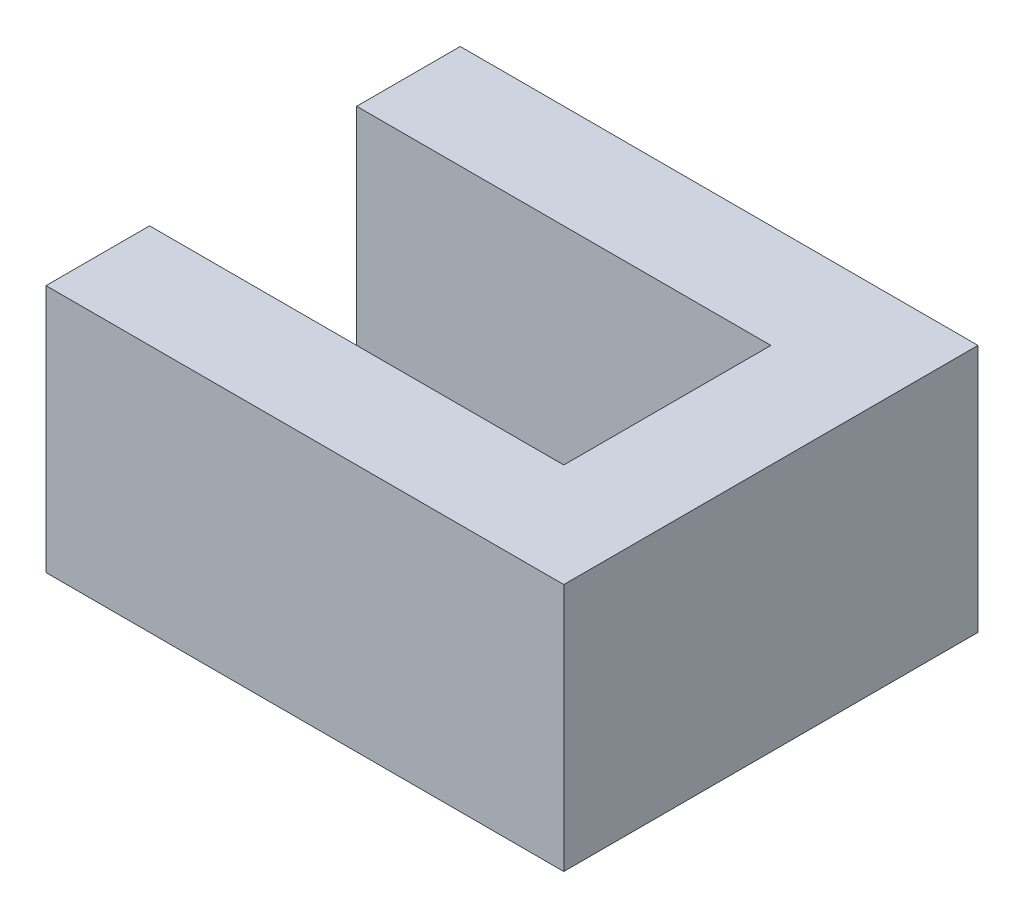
ISO-10303-21;
HEADER;
FILE_DESCRIPTION(('STEP AP214'),'2;1');
FILE_NAME('part.step','',(''),(''),'','','');
FILE_SCHEMA(('AUTOMOTIVE_DESIGN { 1 0 10303 214 1 1 1 1 }'));
ENDSEC;
DATA;
#1=APPLICATION_CONTEXT('core data for automotive mechanical design processes');
#2=APPLICATION_PROTOCOL_DEFINITION('international standard','automotive_design',2000,#1);
#3=PRODUCT_CONTEXT('',#1,'mechanical');
#4=PRODUCT('Part','Part','',(#3));
#5=PRODUCT_RELATED_PRODUCT_CATEGORY('part','',(#4));
#6=PRODUCT_DEFINITION_FORMATION('','',#4);
#7=PRODUCT_DEFINITION_CONTEXT('part definition',#1,'design');
#8=PRODUCT_DEFINITION('design','',#6,#7);
#9=PRODUCT_DEFINITION_SHAPE('','',#8);
#10=(LENGTH_UNIT() NAMED_UNIT(*) SI_UNIT(.MILLI.,.METRE.));
#11=(NAMED_UNIT(*) PLANE_ANGLE_UNIT() SI_UNIT($,.RADIAN.));
#12=(NAMED_UNIT(*) SI_UNIT($,.STERADIAN.) SOLID_ANGLE_UNIT());
#13=UNCERTAINTY_MEASURE_WITH_UNIT(LENGTH_MEASURE(1.E-05),#10,'distance_accuracy_value','');
#14=(GEOMETRIC_REPRESENTATION_CONTEXT(3) GLOBAL_UNCERTAINTY_ASSIGNED_CONTEXT((#13)) GLOBAL_UNIT_ASSIGNED_CONTEXT((#10,
#11,#12)) REPRESENTATION_CONTEXT('',''));
#15=CARTESIAN_POINT('',(0.,0.,0.));
#16=DIRECTION('',(0.,0.,1.));
#17=DIRECTION('',(1.,0.,0.));
#18=AXIS2_PLACEMENT_3D('',#15,#16,#17);
#19=CARTESIAN_POINT('',(0.,24.,10.));
#20=DIRECTION('',(1.,0.,0.));
#21=DIRECTION('',(0.,0.,-1.));
#22=AXIS2_PLACEMENT_3D('',#19,#20,#21);
#23=PLANE('',#22);
#24=DIRECTION('',(0.,0.,1.));
#25=VECTOR('',#24,1.);
#26=CARTESIAN_POINT('',(0.,0.,10.));
#27=LINE('',#26,#25);
#28=CARTESIAN_POINT('',(0.,0.,-10.));
#29=VERTEX_POINT('',#28);
#30=CARTESIAN_POINT('',(0.,0.,10.));
#31=VERTEX_POINT('',#30);
#32=EDGE_CURVE('E99',#29,#31,#27,.T.);
#33=ORIENTED_EDGE('',*,*,#32,.T.);
#34=DIRECTION('',(0.,-1.,0.));
#35=VECTOR('',#34,1.);
#36=CARTESIAN_POINT('',(0.,24.,10.));
#37=LINE('',#36,#35);
#38=CARTESIAN_POINT('',(0.,24.,10.));
#39=VERTEX_POINT('',#38);
#40=EDGE_CURVE('E11',#39,#31,#37,.T.);
#41=ORIENTED_EDGE('',*,*,#40,.F.);
#42=DIRECTION('',(0.,0.,1.));
#43=VECTOR('',#42,1.);
#44=CARTESIAN_POINT('',(0.,24.,10.));
#45=LINE('',#44,#43);
#46=CARTESIAN_POINT('',(0.,24.,-10.));
#47=VERTEX_POINT('',#46);
#48=EDGE_CURVE('E126',#47,#39,#45,.T.);
#49=ORIENTED_EDGE('',*,*,#48,.F.);
#50=DIRECTION('',(0.,-1.,0.));
#51=VECTOR('',#50,1.);
#52=CARTESIAN_POINT('',(0.,24.,-10.));
#53=LINE('',#52,#51);
#54=EDGE_CURVE('E112',#47,#29,#53,.T.);
#55=ORIENTED_EDGE('',*,*,#54,.T.);
#56=EDGE_LOOP('',(#33,#41,#49,#55));
#57=FACE_BOUND('',#56,.T.);
#58=ADVANCED_FACE('F31',(#57),#23,.F.);
#59=CARTESIAN_POINT('',(-40.,24.,10.));
#60=DIRECTION('',(0.,0.,1.));
#61=DIRECTION('',(1.,0.,0.));
#62=AXIS2_PLACEMENT_3D('',#59,#60,#61);
#63=PLANE('',#62);
#64=DIRECTION('',(-1.,0.,0.));
#65=VECTOR('',#64,1.);
#66=CARTESIAN_POINT('',(-40.,0.,10.));
#67=LINE('',#66,#65);
#68=CARTESIAN_POINT('',(-40.,0.,10.));
#69=VERTEX_POINT('',#68);
#70=EDGE_CURVE('E95',#31,#69,#67,.T.);
#71=ORIENTED_EDGE('',*,*,#70,.T.);
#72=DIRECTION('',(0.,-1.,0.));
#73=VECTOR('',#72,1.);
#74=CARTESIAN_POINT('',(-40.,24.,10.));
#75=LINE('',#74,#73);
#76=CARTESIAN_POINT('',(-40.,24.,10.));
#77=VERTEX_POINT('',#76);
#78=EDGE_CURVE('E38',#77,#69,#75,.T.);
#79=ORIENTED_EDGE('',*,*,#78,.F.);
#80=DIRECTION('',(-1.,0.,0.));
#81=VECTOR('',#80,1.);
#82=CARTESIAN_POINT('',(-40.,24.,10.));
#83=LINE('',#82,#81);
#84=EDGE_CURVE('E108',#39,#77,#83,.T.);
#85=ORIENTED_EDGE('',*,*,#84,.F.);
#86=ORIENTED_EDGE('',*,*,#40,.T.);
#87=EDGE_LOOP('',(#71,#79,#85,#86));
#88=FACE_BOUND('',#87,.T.);
#89=ADVANCED_FACE('F107',(#88),#63,.F.);
#90=CARTESIAN_POINT('',(-40.,24.,20.));
#91=DIRECTION('',(1.,0.,0.));
#92=DIRECTION('',(0.,0.,-1.));
#93=AXIS2_PLACEMENT_3D('',#90,#91,#92);
#94=PLANE('',#93);
#95=DIRECTION('',(0.,0.,1.));
#96=VECTOR('',#95,1.);
#97=CARTESIAN_POINT('',(-40.,0.,20.));
#98=LINE('',#97,#96);
#99=CARTESIAN_POINT('',(-40.,0.,20.));
#100=VERTEX_POINT('',#99);
#101=EDGE_CURVE('E101',#69,#100,#98,.T.);
#102=ORIENTED_EDGE('',*,*,#101,.T.);
#103=DIRECTION('',(0.,-1.,0.));
#104=VECTOR('',#103,1.);
#105=CARTESIAN_POINT('',(-40.,24.,20.));
#106=LINE('',#105,#104);
#107=CARTESIAN_POINT('',(-40.,24.,20.));
#108=VERTEX_POINT('',#107);
#109=EDGE_CURVE('E152',#108,#100,#106,.T.);
#110=ORIENTED_EDGE('',*,*,#109,.F.);
#111=DIRECTION('',(0.,0.,1.));
#112=VECTOR('',#111,1.);
#113=CARTESIAN_POINT('',(-40.,24.,20.));
#114=LINE('',#113,#112);
#115=EDGE_CURVE('E129',#77,#108,#114,.T.);
#116=ORIENTED_EDGE('',*,*,#115,.F.);
#117=ORIENTED_EDGE('',*,*,#78,.T.);
#118=EDGE_LOOP('',(#102,#110,#116,#117));
#119=FACE_BOUND('',#118,.T.);
#120=ADVANCED_FACE('F156',(#119),#94,.F.);
#121=CARTESIAN_POINT('',(10.,24.,20.));
#122=DIRECTION('',(0.,0.,-1.));
#123=DIRECTION('',(-1.,0.,0.));
#124=AXIS2_PLACEMENT_3D('',#121,#122,#123);
#125=PLANE('',#124);
#126=DIRECTION('',(1.,0.,0.));
#127=VECTOR('',#126,1.);
#128=CARTESIAN_POINT('',(10.,0.,20.));
#129=LINE('',#128,#127);
#130=CARTESIAN_POINT('',(10.,0.,20.));
#131=VERTEX_POINT('',#130);
#132=EDGE_CURVE('E116',#100,#131,#129,.T.);
#133=ORIENTED_EDGE('',*,*,#132,.T.);
#134=DIRECTION('',(0.,-1.,0.));
#135=VECTOR('',#134,1.);
#136=CARTESIAN_POINT('',(10.,24.,20.));
#137=LINE('',#136,#135);
#138=CARTESIAN_POINT('',(10.,24.,20.));
#139=VERTEX_POINT('',#138);
#140=EDGE_CURVE('E149',#139,#131,#137,.T.);
#141=ORIENTED_EDGE('',*,*,#140,.F.);
#142=DIRECTION('',(1.,0.,0.));
#143=VECTOR('',#142,1.);
#144=CARTESIAN_POINT('',(10.,24.,20.));
#145=LINE('',#144,#143);
#146=EDGE_CURVE('E131',#108,#139,#145,.T.);
#147=ORIENTED_EDGE('',*,*,#146,.F.);
#148=ORIENTED_EDGE('',*,*,#109,.T.);
#149=EDGE_LOOP('',(#133,#141,#147,#148));
#150=FACE_BOUND('',#149,.T.);
#151=ADVANCED_FACE('F164',(#150),#125,.F.);
#152=CARTESIAN_POINT('',(10.,24.,-20.));
#153=DIRECTION('',(-1.,0.,0.));
#154=DIRECTION('',(0.,0.,1.));
#155=AXIS2_PLACEMENT_3D('',#152,#153,#154);
#156=PLANE('',#155);
#157=DIRECTION('',(0.,0.,-1.));
#158=VECTOR('',#157,1.);
#159=CARTESIAN_POINT('',(10.,0.,-20.));
#160=LINE('',#159,#158);
#161=CARTESIAN_POINT('',(10.,0.,-20.));
#162=VERTEX_POINT('',#161);
#163=EDGE_CURVE('E118',#131,#162,#160,.T.);
#164=ORIENTED_EDGE('',*,*,#163,.T.);
#165=DIRECTION('',(0.,-1.,0.));
#166=VECTOR('',#165,1.);
#167=CARTESIAN_POINT('',(10.,24.,-20.));
#168=LINE('',#167,#166);
#169=CARTESIAN_POINT('',(10.,24.,-20.));
#170=VERTEX_POINT('',#169);
#171=EDGE_CURVE('E146',#170,#162,#168,.T.);
#172=ORIENTED_EDGE('',*,*,#171,.F.);
#173=DIRECTION('',(0.,0.,-1.));
#174=VECTOR('',#173,1.);
#175=CARTESIAN_POINT('',(10.,24.,-20.));
#176=LINE('',#175,#174);
#177=EDGE_CURVE('E133',#139,#170,#176,.T.);
#178=ORIENTED_EDGE('',*,*,#177,.F.);
#179=ORIENTED_EDGE('',*,*,#140,.T.);
#180=EDGE_LOOP('',(#164,#172,#178,#179));
#181=FACE_BOUND('',#180,.T.);
#182=ADVANCED_FACE('F167',(#181),#156,.F.);
#183=CARTESIAN_POINT('',(-40.,24.,-20.));
#184=DIRECTION('',(0.,0.,1.));
#185=DIRECTION('',(1.,0.,0.));
#186=AXIS2_PLACEMENT_3D('',#183,#184,#185);
#187=PLANE('',#186);
#188=DIRECTION('',(-1.,0.,0.));
#189=VECTOR('',#188,1.);
#190=CARTESIAN_POINT('',(-40.,0.,-20.));
#191=LINE('',#190,#189);
#192=CARTESIAN_POINT('',(-40.,0.,-20.));
#193=VERTEX_POINT('',#192);
#194=EDGE_CURVE('E120',#162,#193,#191,.T.);
#195=ORIENTED_EDGE('',*,*,#194,.T.);
#196=DIRECTION('',(0.,-1.,0.));
#197=VECTOR('',#196,1.);
#198=CARTESIAN_POINT('',(-40.,24.,-20.));
#199=LINE('',#198,#197);
#200=CARTESIAN_POINT('',(-40.,24.,-20.));
#201=VERTEX_POINT('',#200);
#202=EDGE_CURVE('E143',#201,#193,#199,.T.);
#203=ORIENTED_EDGE('',*,*,#202,.F.);
#204=DIRECTION('',(-1.,0.,0.));
#205=VECTOR('',#204,1.);
#206=CARTESIAN_POINT('',(-40.,24.,-20.));
#207=LINE('',#206,#205);
#208=EDGE_CURVE('E135',#170,#201,#207,.T.);
#209=ORIENTED_EDGE('',*,*,#208,.F.);
#210=ORIENTED_EDGE('',*,*,#171,.T.);
#211=EDGE_LOOP('',(#195,#203,#209,#210));
#212=FACE_BOUND('',#211,.T.);
#213=ADVANCED_FACE('F172',(#212),#187,.F.);
#214=CARTESIAN_POINT('',(-40.,24.,-10.));
#215=DIRECTION('',(1.,0.,0.));
#216=DIRECTION('',(0.,0.,-1.));
#217=AXIS2_PLACEMENT_3D('',#214,#215,#216);
#218=PLANE('',#217);
#219=DIRECTION('',(0.,0.,1.));
#220=VECTOR('',#219,1.);
#221=CARTESIAN_POINT('',(-40.,0.,-10.));
#222=LINE('',#221,#220);
#223=CARTESIAN_POINT('',(-40.,0.,-10.));
#224=VERTEX_POINT('',#223);
#225=EDGE_CURVE('E122',#193,#224,#222,.T.);
#226=ORIENTED_EDGE('',*,*,#225,.T.);
#227=DIRECTION('',(0.,-1.,0.));
#228=VECTOR('',#227,1.);
#229=CARTESIAN_POINT('',(-40.,24.,-10.));
#230=LINE('',#229,#228);
#231=CARTESIAN_POINT('',(-40.,24.,-10.));
#232=VERTEX_POINT('',#231);
#233=EDGE_CURVE('E140',#232,#224,#230,.T.);
#234=ORIENTED_EDGE('',*,*,#233,.F.);
#235=DIRECTION('',(0.,0.,1.));
#236=VECTOR('',#235,1.);
#237=CARTESIAN_POINT('',(-40.,24.,-10.));
#238=LINE('',#237,#236);
#239=EDGE_CURVE('E50',#201,#232,#238,.T.);
#240=ORIENTED_EDGE('',*,*,#239,.F.);
#241=ORIENTED_EDGE('',*,*,#202,.T.);
#242=EDGE_LOOP('',(#226,#234,#240,#241));
#243=FACE_BOUND('',#242,.T.);
#244=ADVANCED_FACE('F175',(#243),#218,.F.);
#245=CARTESIAN_POINT('',(0.,24.,-10.));
#246=DIRECTION('',(0.,0.,-1.));
#247=DIRECTION('',(-1.,0.,0.));
#248=AXIS2_PLACEMENT_3D('',#245,#246,#247);
#249=PLANE('',#248);
#250=DIRECTION('',(1.,0.,0.));
#251=VECTOR('',#250,1.);
#252=CARTESIAN_POINT('',(0.,0.,-10.));
#253=LINE('',#252,#251);
#254=EDGE_CURVE('E124',#224,#29,#253,.T.);
#255=ORIENTED_EDGE('',*,*,#254,.T.);
#256=ORIENTED_EDGE('',*,*,#54,.F.);
#257=DIRECTION('',(1.,0.,0.));
#258=VECTOR('',#257,1.);
#259=CARTESIAN_POINT('',(0.,24.,-10.));
#260=LINE('',#259,#258);
#261=EDGE_CURVE('E45',#232,#47,#260,.T.);
#262=ORIENTED_EDGE('',*,*,#261,.F.);
#263=ORIENTED_EDGE('',*,*,#233,.T.);
#264=EDGE_LOOP('',(#255,#256,#262,#263));
#265=FACE_BOUND('',#264,.T.);
#266=ADVANCED_FACE('F177',(#265),#249,.F.);
#267=CARTESIAN_POINT('',(0.,24.,-20.));
#268=DIRECTION('',(0.,-1.,0.));
#269=DIRECTION('',(0.,0.,-1.));
#270=AXIS2_PLACEMENT_3D('',#267,#268,#269);
#271=PLANE('',#270);
#272=ORIENTED_EDGE('',*,*,#48,.T.);
#273=ORIENTED_EDGE('',*,*,#84,.T.);
#274=ORIENTED_EDGE('',*,*,#115,.T.);
#275=ORIENTED_EDGE('',*,*,#146,.T.);
#276=ORIENTED_EDGE('',*,*,#177,.T.);
#277=ORIENTED_EDGE('',*,*,#208,.T.);
#278=ORIENTED_EDGE('',*,*,#239,.T.);
#279=ORIENTED_EDGE('',*,*,#261,.T.);
#280=EDGE_LOOP('',(#272,#273,#274,#275,#276,#277,#278,#279));
#281=FACE_BOUND('',#280,.T.);
#282=ADVANCED_FACE('F159',(#281),#271,.F.);
#283=CARTESIAN_POINT('',(0.,0.,-20.));
#284=DIRECTION('',(0.,-1.,0.));
#285=DIRECTION('',(0.,0.,-1.));
#286=AXIS2_PLACEMENT_3D('',#283,#284,#285);
#287=PLANE('',#286);
#288=ORIENTED_EDGE('',*,*,#32,.F.);
#289=ORIENTED_EDGE('',*,*,#254,.F.);
#290=ORIENTED_EDGE('',*,*,#225,.F.);
#291=ORIENTED_EDGE('',*,*,#194,.F.);
#292=ORIENTED_EDGE('',*,*,#163,.F.);
#293=ORIENTED_EDGE('',*,*,#132,.F.);
#294=ORIENTED_EDGE('',*,*,#101,.F.);
#295=ORIENTED_EDGE('',*,*,#70,.F.);
#296=EDGE_LOOP('',(#288,#289,#290,#291,#292,#293,#294,#295));
#297=FACE_BOUND('',#296,.T.);
#298=ADVANCED_FACE('F96',(#297),#287,.T.);
#299=CLOSED_SHELL('',(#58,#89,#120,#151,#182,#213,#244,#266,#282,#298));
#300=MANIFOLD_SOLID_BREP('B2',#299);
#301=ADVANCED_BREP_SHAPE_REPRESENTATION('',(#18,#300),#14);
#302=SHAPE_DEFINITION_REPRESENTATION(#9,#301);
ENDSEC;
END-ISO-10303-21;
